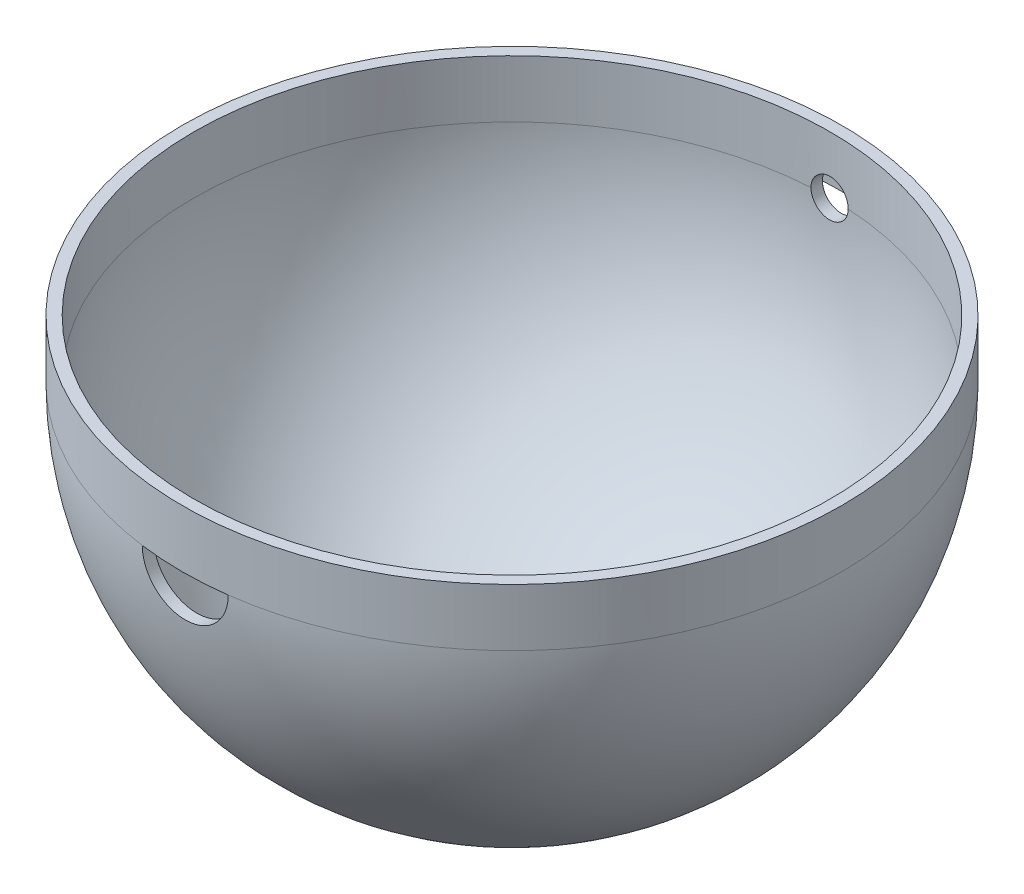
ISO-10303-21;
HEADER;
FILE_DESCRIPTION(('STEP AP214'),'2;1');
FILE_NAME('part.step','',(''),(''),'','','');
FILE_SCHEMA(('AUTOMOTIVE_DESIGN { 1 0 10303 214 1 1 1 1 }'));
ENDSEC;
DATA;
#1=APPLICATION_CONTEXT('core data for automotive mechanical design processes');
#2=APPLICATION_PROTOCOL_DEFINITION('international standard','automotive_design',2000,#1);
#3=PRODUCT_CONTEXT('',#1,'mechanical');
#4=PRODUCT('Part','Part','',(#3));
#5=PRODUCT_RELATED_PRODUCT_CATEGORY('part','',(#4));
#6=PRODUCT_DEFINITION_FORMATION('','',#4);
#7=PRODUCT_DEFINITION_CONTEXT('part definition',#1,'design');
#8=PRODUCT_DEFINITION('design','',#6,#7);
#9=PRODUCT_DEFINITION_SHAPE('','',#8);
#10=(LENGTH_UNIT() NAMED_UNIT(*) SI_UNIT(.MILLI.,.METRE.));
#11=(NAMED_UNIT(*) PLANE_ANGLE_UNIT() SI_UNIT($,.RADIAN.));
#12=(NAMED_UNIT(*) SI_UNIT($,.STERADIAN.) SOLID_ANGLE_UNIT());
#13=UNCERTAINTY_MEASURE_WITH_UNIT(LENGTH_MEASURE(1.E-05),#10,'distance_accuracy_value','');
#14=(GEOMETRIC_REPRESENTATION_CONTEXT(3) GLOBAL_UNCERTAINTY_ASSIGNED_CONTEXT((#13)) GLOBAL_UNIT_ASSIGNED_CONTEXT((#10,
#11,#12)) REPRESENTATION_CONTEXT('',''));
#15=CARTESIAN_POINT('',(0.,0.,0.));
#16=DIRECTION('',(0.,0.,1.));
#17=DIRECTION('',(1.,0.,0.));
#18=AXIS2_PLACEMENT_3D('',#15,#16,#17);
#19=CARTESIAN_POINT('',(0.,17.78,0.));
#20=DIRECTION('',(0.,1.,0.));
#21=DIRECTION('',(-1.,0.,0.));
#22=AXIS2_PLACEMENT_3D('',#19,#20,#21);
#23=SPHERICAL_SURFACE('',#22,29.21);
#24=CARTESIAN_POINT('',(0.,17.78,0.));
#25=DIRECTION('',(0.,1.,0.));
#26=DIRECTION('',(-1.,0.,0.));
#27=AXIS2_PLACEMENT_3D('',#24,#25,#26);
#28=CIRCLE('',#27,29.21);
#29=CARTESIAN_POINT('',(-1.65100000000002,17.78,-29.1633039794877));
#30=VERTEX_POINT('',#29);
#31=CARTESIAN_POINT('',(-3.81000000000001,17.78,28.9604557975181));
#32=VERTEX_POINT('',#31);
#33=EDGE_CURVE('E76',#30,#32,#28,.T.);
#34=ORIENTED_EDGE('',*,*,#33,.F.);
#35=CARTESIAN_POINT('',(0.,17.78,-29.1633039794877));
#36=DIRECTION('',(0.,0.,1.));
#37=DIRECTION('',(1.,0.,0.));
#38=AXIS2_PLACEMENT_3D('',#35,#36,#37);
#39=CIRCLE('',#38,1.651);
#40=CARTESIAN_POINT('',(1.65100000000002,17.78,-29.1633039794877));
#41=VERTEX_POINT('',#40);
#42=EDGE_CURVE('E49',#41,#30,#39,.F.);
#43=ORIENTED_EDGE('',*,*,#42,.F.);
#44=CARTESIAN_POINT('',(3.81000000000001,17.78,28.9604557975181));
#45=VERTEX_POINT('',#44);
#46=EDGE_CURVE('E75',#45,#41,#28,.T.);
#47=ORIENTED_EDGE('',*,*,#46,.F.);
#48=CARTESIAN_POINT('',(0.,17.78,28.9604557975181));
#49=DIRECTION('',(0.,0.,-1.));
#50=DIRECTION('',(-1.,0.,0.));
#51=AXIS2_PLACEMENT_3D('',#48,#49,#50);
#52=CIRCLE('',#51,3.81);
#53=EDGE_CURVE('E127',#45,#32,#52,.T.);
#54=ORIENTED_EDGE('',*,*,#53,.T.);
#55=EDGE_LOOP('',(#34,#43,#47,#54));
#56=FACE_BOUND('',#55,.T.);
#57=ADVANCED_FACE('F29',(#56),#23,.T.);
#58=CARTESIAN_POINT('',(0.,105.478356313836,0.));
#59=DIRECTION('',(0.,-1.,0.));
#60=DIRECTION('',(1.,0.,0.));
#61=AXIS2_PLACEMENT_3D('',#58,#59,#60);
#62=CYLINDRICAL_SURFACE('',#61,28.194);
#63=CARTESIAN_POINT('',(1.651,17.78,-28.1456183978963));
#64=CARTESIAN_POINT('',(1.65099973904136,17.8264069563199,-28.1456177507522));
#65=CARTESIAN_POINT('',(1.64904213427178,17.8727916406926,-28.1457333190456));
#66=CARTESIAN_POINT('',(1.64123276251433,17.965228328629,-28.1461900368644));
#67=CARTESIAN_POINT('',(1.63538120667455,18.0112803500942,-28.1465311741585));
#68=CARTESIAN_POINT('',(1.61204203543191,18.1483603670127,-28.1478811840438));
#69=CARTESIAN_POINT('',(1.58876975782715,18.2384688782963,-28.1492166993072));
#70=CARTESIAN_POINT('',(1.52745150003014,18.4134876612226,-28.1526101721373));
#71=CARTESIAN_POINT('',(1.48939910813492,18.498395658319,-28.1546684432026));
#72=CARTESIAN_POINT('',(1.3996080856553,18.6606169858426,-28.1592746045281));
#73=CARTESIAN_POINT('',(1.34787178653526,18.7379316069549,-28.161822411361));
#74=CARTESIAN_POINT('',(1.23211245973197,18.882865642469,-28.1671241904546));
#75=CARTESIAN_POINT('',(1.16807609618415,18.9504743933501,-28.1698783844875));
#76=CARTESIAN_POINT('',(1.02955278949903,19.0739994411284,-28.1752808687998));
#77=CARTESIAN_POINT('',(0.955064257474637,19.129913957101,-28.177929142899));
#78=CARTESIAN_POINT('',(0.797695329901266,19.2284851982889,-28.1828229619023));
#79=CARTESIAN_POINT('',(0.714809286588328,19.2711329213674,-28.1850682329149));
#80=CARTESIAN_POINT('',(0.543043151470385,19.3419002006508,-28.1889005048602));
#81=CARTESIAN_POINT('',(0.454163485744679,19.3700207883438,-28.190487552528));
#82=CARTESIAN_POINT('',(0.273035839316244,19.4109084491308,-28.1928231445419));
#83=CARTESIAN_POINT('',(0.180791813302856,19.4236929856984,-28.1935726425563));
#84=CARTESIAN_POINT('',(-0.00453808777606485,19.4335996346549,-28.1941518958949));
#85=CARTESIAN_POINT('',(-0.0976239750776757,19.4307215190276,-28.1939816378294));
#86=CARTESIAN_POINT('',(-0.281871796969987,19.4093984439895,-28.1927413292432));
#87=CARTESIAN_POINT('',(-0.373035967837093,19.3909727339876,-28.19167239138));
#88=CARTESIAN_POINT('',(-0.550974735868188,19.3391074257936,-28.1887563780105));
#89=CARTESIAN_POINT('',(-0.637749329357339,19.3056678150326,-28.1869093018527));
#90=CARTESIAN_POINT('',(-0.804509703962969,19.2247013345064,-28.1826430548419));
#91=CARTESIAN_POINT('',(-0.884491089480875,19.1771654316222,-28.1802235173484));
#92=CARTESIAN_POINT('',(-1.03534239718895,19.0693645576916,-28.1750848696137));
#93=CARTESIAN_POINT('',(-1.10621266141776,19.0091000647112,-28.1723657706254));
#94=CARTESIAN_POINT('',(-1.23693716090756,18.8774538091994,-28.1669295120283));
#95=CARTESIAN_POINT('',(-1.29677618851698,18.8060569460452,-28.1642123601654));
#96=CARTESIAN_POINT('',(-1.40364017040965,18.6541944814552,-28.1590891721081));
#97=CARTESIAN_POINT('',(-1.45066111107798,18.5737260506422,-28.1566832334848));
#98=CARTESIAN_POINT('',(-1.5305509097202,18.4059847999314,-28.1524538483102));
#99=CARTESIAN_POINT('',(-1.56341054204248,18.3187075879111,-28.1506307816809));
#100=CARTESIAN_POINT('',(-1.61395571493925,18.1399290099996,-28.1477785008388));
#101=CARTESIAN_POINT('',(-1.63166435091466,18.0484342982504,-28.1467480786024));
#102=CARTESIAN_POINT('',(-1.64471410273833,17.9269337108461,-28.1459864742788));
#103=CARTESIAN_POINT('',(-1.64707253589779,17.8975707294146,-28.1458485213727));
#104=CARTESIAN_POINT('',(-1.65021333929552,17.8388091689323,-28.1456646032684));
#105=CARTESIAN_POINT('',(-1.65099832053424,17.8094107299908,-28.1456184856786));
#106=CARTESIAN_POINT('',(-1.651,17.78,-28.1456183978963));
#107=B_SPLINE_CURVE_WITH_KNOTS('',3,(#63,#64,#65,#66,#67,#68,#69,#70,#71,#72,#73,#74,#75,#76,
#77,#78,#79,#80,#81,#82,#83,#84,#85,#86,#87,#88,#89,#90,#91,#92,#93,#94,#95,#96,#97,#98,#99,
#100,#101,#102,#103,#104,#105,#106),.UNSPECIFIED.,.F.,.F.,(4,2,2,2,2,2,2,2,2,2,2,2,2,2,2,2,2,2,
2,2,2,4),(0.,0.139135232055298,0.278262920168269,0.556054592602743,0.833966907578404,
1.11183190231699,1.38999987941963,1.66821018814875,1.94660886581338,2.22498777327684,
2.5030493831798,2.78111504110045,3.05883693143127,3.33655905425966,3.61445953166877,
3.8923495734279,4.17061989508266,4.44897724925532,4.72751567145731,5.00562874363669,
5.09397257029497,5.18216967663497),.UNSPECIFIED.);
#108=CARTESIAN_POINT('',(1.65099999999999,17.78,-28.1456183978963));
#109=VERTEX_POINT('',#108);
#110=CARTESIAN_POINT('',(-1.65099999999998,17.78,-28.1456183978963));
#111=VERTEX_POINT('',#110);
#112=EDGE_CURVE('E42',#109,#111,#107,.T.);
#113=ORIENTED_EDGE('',*,*,#112,.F.);
#114=CARTESIAN_POINT('',(0.,17.78,0.));
#115=DIRECTION('',(0.,1.,0.));
#116=DIRECTION('',(-1.,0.,0.));
#117=AXIS2_PLACEMENT_3D('',#114,#115,#116);
#118=CIRCLE('',#117,28.194);
#119=CARTESIAN_POINT('',(3.81,17.78,27.9353814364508));
#120=VERTEX_POINT('',#119);
#121=EDGE_CURVE('E94',#120,#109,#118,.T.);
#122=ORIENTED_EDGE('',*,*,#121,.F.);
#123=CARTESIAN_POINT('',(3.81,17.78,27.9353814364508));
#124=CARTESIAN_POINT('',(3.81001083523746,17.8866389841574,27.9353753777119));
#125=CARTESIAN_POINT('',(3.80552296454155,17.9932724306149,27.9359919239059));
#126=CARTESIAN_POINT('',(3.78763375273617,18.2057667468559,27.9384254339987));
#127=CARTESIAN_POINT('',(3.77423314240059,18.3116276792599,27.9402422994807));
#128=CARTESIAN_POINT('',(3.73862155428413,18.5217200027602,27.945029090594));
#129=CARTESIAN_POINT('',(3.71642008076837,18.6259530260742,27.9479977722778));
#130=CARTESIAN_POINT('',(3.66339438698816,18.8321350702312,27.9549975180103));
#131=CARTESIAN_POINT('',(3.63257020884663,18.9340841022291,27.9590285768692));
#132=CARTESIAN_POINT('',(3.52743909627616,19.2354906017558,27.9725558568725));
#133=CARTESIAN_POINT('',(3.44045243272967,19.430631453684,27.9834892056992));
#134=CARTESIAN_POINT('',(3.23530082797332,19.8034287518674,28.0079464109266));
#135=CARTESIAN_POINT('',(3.11713770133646,19.9810862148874,28.0214701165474));
#136=CARTESIAN_POINT('',(2.85214530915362,20.3151635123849,28.0496829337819));
#137=CARTESIAN_POINT('',(2.70515578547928,20.4714559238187,28.0643782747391));
#138=CARTESIAN_POINT('',(2.38701989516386,20.7572429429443,28.093223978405));
#139=CARTESIAN_POINT('',(2.21586985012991,20.8867334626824,28.1073742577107));
#140=CARTESIAN_POINT('',(1.8534615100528,21.1156995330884,28.1335991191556));
#141=CARTESIAN_POINT('',(1.66212818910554,21.2150573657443,28.1456654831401));
#142=CARTESIAN_POINT('',(1.26531187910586,21.380175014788,28.166292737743));
#143=CARTESIAN_POINT('',(1.05983033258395,21.445938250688,28.1748539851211));
#144=CARTESIAN_POINT('',(0.641868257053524,21.5416201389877,28.1874629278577));
#145=CARTESIAN_POINT('',(0.429437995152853,21.5717547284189,28.1915378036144));
#146=CARTESIAN_POINT('',(0.00249422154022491,21.5959935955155,28.1948078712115));
#147=CARTESIAN_POINT('',(-0.21201924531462,21.5900986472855,28.1940031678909));
#148=CARTESIAN_POINT('',(-0.635558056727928,21.5426164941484,28.1876264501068));
#149=CARTESIAN_POINT('',(-0.844610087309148,21.5012625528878,28.1820855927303));
#150=CARTESIAN_POINT('',(-1.25277855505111,21.3844019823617,28.1668940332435));
#151=CARTESIAN_POINT('',(-1.45189483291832,21.3088948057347,28.1572432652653));
#152=CARTESIAN_POINT('',(-1.83526049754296,21.1256241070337,28.1348623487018));
#153=CARTESIAN_POINT('',(-2.01946125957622,21.0177600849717,28.1221226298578));
#154=CARTESIAN_POINT('',(-2.36722759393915,20.7729189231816,28.0949877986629));
#155=CARTESIAN_POINT('',(-2.53079290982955,20.6359414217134,28.0805926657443));
#156=CARTESIAN_POINT('',(-2.83400762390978,20.3354648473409,28.05162144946));
#157=CARTESIAN_POINT('',(-2.97345892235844,20.1717657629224,28.037044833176));
#158=CARTESIAN_POINT('',(-3.22297512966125,19.8231643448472,28.0094604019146));
#159=CARTESIAN_POINT('',(-3.33303139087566,19.6382557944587,27.9964530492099));
#160=CARTESIAN_POINT('',(-3.52067919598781,19.2520671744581,27.9734781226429));
#161=CARTESIAN_POINT('',(-3.59823391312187,19.0507688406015,27.9635140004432));
#162=CARTESIAN_POINT('',(-3.68826688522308,18.7414385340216,27.951729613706));
#163=CARTESIAN_POINT('',(-3.7138924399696,18.6371174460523,27.9483287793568));
#164=CARTESIAN_POINT('',(-3.75625009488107,18.4266679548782,27.9426679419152));
#165=CARTESIAN_POINT('',(-3.77298649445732,18.3205404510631,27.9404073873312));
#166=CARTESIAN_POINT('',(-3.79347299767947,18.1418428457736,27.9376317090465));
#167=CARTESIAN_POINT('',(-3.79967411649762,18.0695471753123,27.936788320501));
#168=CARTESIAN_POINT('',(-3.80793458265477,17.9248373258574,27.9356631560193));
#169=CARTESIAN_POINT('',(-3.81000088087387,17.8524235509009,27.9353804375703));
#170=CARTESIAN_POINT('',(-3.81,17.78,27.9353814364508));
#171=B_SPLINE_CURVE_WITH_KNOTS('',3,(#123,#124,#125,#126,#127,#128,#129,#130,#131,#132,#133,
#134,#135,#136,#137,#138,#139,#140,#141,#142,#143,#144,#145,#146,#147,#148,#149,#150,#151,#152,
#153,#154,#155,#156,#157,#158,#159,#160,#161,#162,#163,#164,#165,#166,#167,#168,#169,#170),
.UNSPECIFIED.,.F.,.F.,(4,2,2,2,2,2,2,2,2,2,2,2,2,2,2,2,2,2,2,2,2,2,2,4),(0.,0.319810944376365,
0.639595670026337,0.959035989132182,1.27847474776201,1.91697959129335,2.55544727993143,
3.1975706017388,3.83979179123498,4.48449052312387,5.12912361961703,5.76982938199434,
6.41052137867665,7.04703069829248,7.68355021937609,8.32206760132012,8.96059291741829,
9.60413741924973,10.2478710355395,10.892332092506,11.2144464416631,11.536404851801,
11.7539921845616,11.9712134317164),.UNSPECIFIED.);
#172=CARTESIAN_POINT('',(-3.80999999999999,17.78,27.9353814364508));
#173=VERTEX_POINT('',#172);
#174=EDGE_CURVE('E98',#120,#173,#171,.T.);
#175=ORIENTED_EDGE('',*,*,#174,.T.);
#176=EDGE_CURVE('E97',#111,#173,#118,.T.);
#177=ORIENTED_EDGE('',*,*,#176,.F.);
#178=EDGE_LOOP('',(#113,#122,#175,#177));
#179=FACE_BOUND('',#178,.T.);
#180=CARTESIAN_POINT('',(0.,22.86,0.));
#181=DIRECTION('',(0.,1.,0.));
#182=DIRECTION('',(-1.,0.,0.));
#183=AXIS2_PLACEMENT_3D('',#180,#181,#182);
#184=CIRCLE('',#183,28.194);
#185=CARTESIAN_POINT('',(-28.194,22.86,0.));
#186=VERTEX_POINT('',#185);
#187=EDGE_CURVE('E91',#186,#186,#184,.T.);
#188=ORIENTED_EDGE('',*,*,#187,.T.);
#189=EDGE_LOOP('',(#188));
#190=FACE_BOUND('',#189,.T.);
#191=ADVANCED_FACE('F108',(#179,#190),#62,.F.);
#192=CARTESIAN_POINT('',(0.,17.78,0.));
#193=DIRECTION('',(0.,1.,0.));
#194=DIRECTION('',(-1.,0.,0.));
#195=AXIS2_PLACEMENT_3D('',#192,#193,#194);
#196=SPHERICAL_SURFACE('',#195,28.194);
#197=CARTESIAN_POINT('',(0.,17.78,-28.1456183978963));
#198=DIRECTION('',(0.,0.,1.));
#199=DIRECTION('',(1.,0.,0.));
#200=AXIS2_PLACEMENT_3D('',#197,#198,#199);
#201=CIRCLE('',#200,1.651);
#202=EDGE_CURVE('E83',#111,#109,#201,.T.);
#203=ORIENTED_EDGE('',*,*,#202,.F.);
#204=ORIENTED_EDGE('',*,*,#176,.T.);
#205=CARTESIAN_POINT('',(0.,17.78,27.9353814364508));
#206=DIRECTION('',(0.,0.,-1.));
#207=DIRECTION('',(-1.,0.,0.));
#208=AXIS2_PLACEMENT_3D('',#205,#206,#207);
#209=CIRCLE('',#208,3.81);
#210=EDGE_CURVE('E11',#173,#120,#209,.F.);
#211=ORIENTED_EDGE('',*,*,#210,.T.);
#212=ORIENTED_EDGE('',*,*,#121,.T.);
#213=EDGE_LOOP('',(#203,#204,#211,#212));
#214=FACE_BOUND('',#213,.T.);
#215=ADVANCED_FACE('F133',(#214),#196,.F.);
#216=CARTESIAN_POINT('',(0.,22.86,0.));
#217=DIRECTION('',(0.,1.,0.));
#218=DIRECTION('',(-1.,0.,0.));
#219=AXIS2_PLACEMENT_3D('',#216,#217,#218);
#220=PLANE('',#219);
#221=CARTESIAN_POINT('',(0.,22.86,0.));
#222=DIRECTION('',(0.,1.,0.));
#223=DIRECTION('',(-1.,0.,0.));
#224=AXIS2_PLACEMENT_3D('',#221,#222,#223);
#225=CIRCLE('',#224,29.21);
#226=CARTESIAN_POINT('',(-29.21,22.86,0.));
#227=VERTEX_POINT('',#226);
#228=EDGE_CURVE('E88',#227,#227,#225,.T.);
#229=ORIENTED_EDGE('',*,*,#228,.T.);
#230=EDGE_LOOP('',(#229));
#231=FACE_BOUND('',#230,.T.);
#232=ORIENTED_EDGE('',*,*,#187,.F.);
#233=EDGE_LOOP('',(#232));
#234=FACE_BOUND('',#233,.T.);
#235=ADVANCED_FACE('F139',(#231,#234),#220,.T.);
#236=CARTESIAN_POINT('',(0.,105.478356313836,0.));
#237=DIRECTION('',(0.,-1.,0.));
#238=DIRECTION('',(1.,0.,0.));
#239=AXIS2_PLACEMENT_3D('',#236,#237,#238);
#240=CYLINDRICAL_SURFACE('',#239,29.21);
#241=EDGE_CURVE('E36',#32,#45,#28,.T.);
#242=ORIENTED_EDGE('',*,*,#241,.T.);
#243=ORIENTED_EDGE('',*,*,#46,.T.);
#244=EDGE_CURVE('E69',#41,#30,#28,.T.);
#245=ORIENTED_EDGE('',*,*,#244,.T.);
#246=ORIENTED_EDGE('',*,*,#33,.T.);
#247=EDGE_LOOP('',(#242,#243,#245,#246));
#248=FACE_BOUND('',#247,.T.);
#249=ORIENTED_EDGE('',*,*,#228,.F.);
#250=EDGE_LOOP('',(#249));
#251=FACE_BOUND('',#250,.T.);
#252=ADVANCED_FACE('F84',(#248,#251),#240,.T.);
#253=CARTESIAN_POINT('',(0.,17.78,0.));
#254=DIRECTION('',(0.,1.,0.));
#255=DIRECTION('',(-1.,0.,0.));
#256=AXIS2_PLACEMENT_3D('',#253,#254,#255);
#257=SPHERICAL_SURFACE('',#256,29.21);
#258=ORIENTED_EDGE('',*,*,#241,.F.);
#259=EDGE_CURVE('E106',#32,#45,#52,.T.);
#260=ORIENTED_EDGE('',*,*,#259,.T.);
#261=EDGE_LOOP('',(#258,#260));
#262=FACE_BOUND('',#261,.T.);
#263=ADVANCED_FACE('F115',(#262),#257,.F.);
#264=CARTESIAN_POINT('',(0.,17.78,29.211));
#265=DIRECTION('',(0.,0.,-1.));
#266=DIRECTION('',(-1.,0.,0.));
#267=AXIS2_PLACEMENT_3D('',#264,#265,#266);
#268=CYLINDRICAL_SURFACE('',#267,3.81);
#269=ORIENTED_EDGE('',*,*,#210,.F.);
#270=ORIENTED_EDGE('',*,*,#174,.F.);
#271=EDGE_LOOP('',(#269,#270));
#272=FACE_BOUND('',#271,.T.);
#273=ORIENTED_EDGE('',*,*,#259,.F.);
#274=ORIENTED_EDGE('',*,*,#53,.F.);
#275=EDGE_LOOP('',(#273,#274));
#276=FACE_BOUND('',#275,.T.);
#277=ADVANCED_FACE('F111',(#272,#276),#268,.F.);
#278=CARTESIAN_POINT('',(0.,17.78,0.));
#279=DIRECTION('',(0.,1.,0.));
#280=DIRECTION('',(-1.,0.,0.));
#281=AXIS2_PLACEMENT_3D('',#278,#279,#280);
#282=SPHERICAL_SURFACE('',#281,29.21);
#283=ORIENTED_EDGE('',*,*,#244,.F.);
#284=EDGE_CURVE('E71',#30,#41,#39,.F.);
#285=ORIENTED_EDGE('',*,*,#284,.F.);
#286=EDGE_LOOP('',(#283,#285));
#287=FACE_BOUND('',#286,.T.);
#288=ADVANCED_FACE('F70',(#287),#282,.F.);
#289=CARTESIAN_POINT('',(0.,17.78,-29.211));
#290=DIRECTION('',(0.,0.,1.));
#291=DIRECTION('',(1.,0.,0.));
#292=AXIS2_PLACEMENT_3D('',#289,#290,#291);
#293=CYLINDRICAL_SURFACE('',#292,1.651);
#294=ORIENTED_EDGE('',*,*,#112,.T.);
#295=ORIENTED_EDGE('',*,*,#202,.T.);
#296=EDGE_LOOP('',(#294,#295));
#297=FACE_BOUND('',#296,.T.);
#298=ORIENTED_EDGE('',*,*,#42,.T.);
#299=ORIENTED_EDGE('',*,*,#284,.T.);
#300=EDGE_LOOP('',(#298,#299));
#301=FACE_BOUND('',#300,.T.);
#302=ADVANCED_FACE('F77',(#297,#301),#293,.F.);
#303=CLOSED_SHELL('',(#57,#191,#215,#235,#252,#263,#277,#288,#302));
#304=MANIFOLD_SOLID_BREP('B2',#303);
#305=ADVANCED_BREP_SHAPE_REPRESENTATION('',(#18,#304),#14);
#306=SHAPE_DEFINITION_REPRESENTATION(#9,#305);
ENDSEC;
END-ISO-10303-21;
